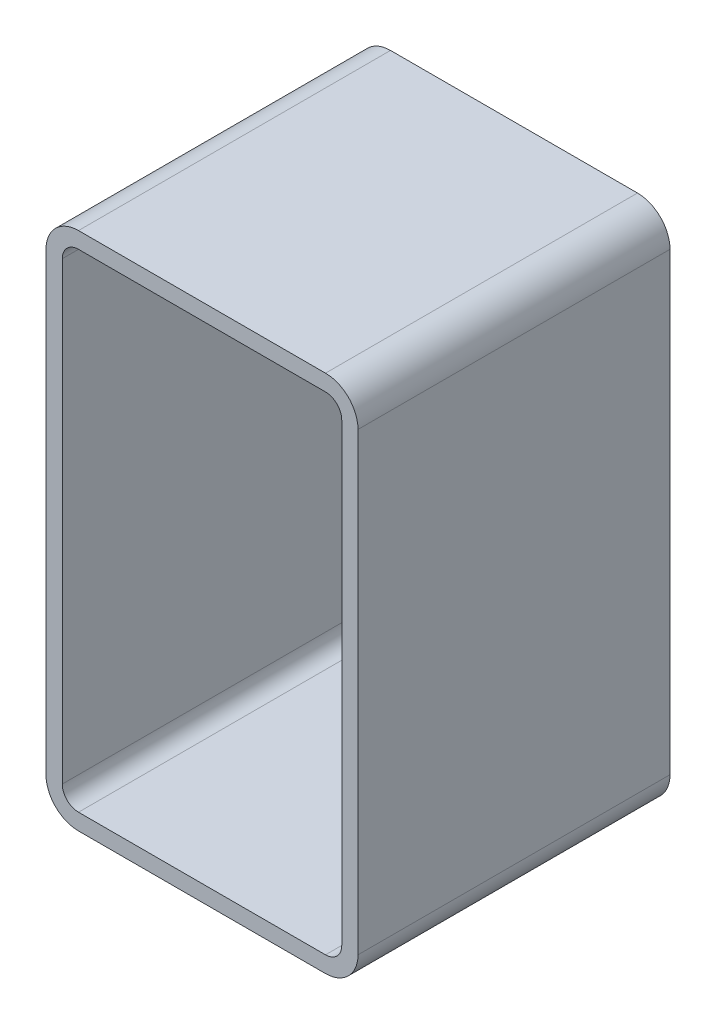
ISO-10303-21;
HEADER;
FILE_DESCRIPTION(('STEP AP214'),'2;1');
FILE_NAME('part.step','',(''),(''),'','','');
FILE_SCHEMA(('AUTOMOTIVE_DESIGN { 1 0 10303 214 1 1 1 1 }'));
ENDSEC;
DATA;
#1=APPLICATION_CONTEXT('core data for automotive mechanical design processes');
#2=APPLICATION_PROTOCOL_DEFINITION('international standard','automotive_design',2000,#1);
#3=PRODUCT_CONTEXT('',#1,'mechanical');
#4=PRODUCT('Part','Part','',(#3));
#5=PRODUCT_RELATED_PRODUCT_CATEGORY('part','',(#4));
#6=PRODUCT_DEFINITION_FORMATION('','',#4);
#7=PRODUCT_DEFINITION_CONTEXT('part definition',#1,'design');
#8=PRODUCT_DEFINITION('design','',#6,#7);
#9=PRODUCT_DEFINITION_SHAPE('','',#8);
#10=(LENGTH_UNIT() NAMED_UNIT(*) SI_UNIT(.MILLI.,.METRE.));
#11=(NAMED_UNIT(*) PLANE_ANGLE_UNIT() SI_UNIT($,.RADIAN.));
#12=(NAMED_UNIT(*) SI_UNIT($,.STERADIAN.) SOLID_ANGLE_UNIT());
#13=UNCERTAINTY_MEASURE_WITH_UNIT(LENGTH_MEASURE(1.E-05),#10,'distance_accuracy_value','');
#14=(GEOMETRIC_REPRESENTATION_CONTEXT(3) GLOBAL_UNCERTAINTY_ASSIGNED_CONTEXT((#13)) GLOBAL_UNIT_ASSIGNED_CONTEXT((#10,
#11,#12)) REPRESENTATION_CONTEXT('',''));
#15=CARTESIAN_POINT('',(0.,0.,0.));
#16=DIRECTION('',(0.,0.,1.));
#17=DIRECTION('',(1.,0.,0.));
#18=AXIS2_PLACEMENT_3D('',#15,#16,#17);
#19=CARTESIAN_POINT('',(32.8567030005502,477.941228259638,304.8));
#20=DIRECTION('',(0.,0.,1.));
#21=DIRECTION('',(1.,0.,0.));
#22=AXIS2_PLACEMENT_3D('',#19,#20,#21);
#23=PLANE('',#22);
#24=CARTESIAN_POINT('',(32.8567030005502,477.941228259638,304.8));
#25=DIRECTION('',(0.,0.,1.));
#26=DIRECTION('',(1.,0.,0.));
#27=AXIS2_PLACEMENT_3D('',#24,#25,#26);
#28=CIRCLE('',#27,31.75);
#29=CARTESIAN_POINT('',(32.8567030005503,509.691228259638,304.8));
#30=VERTEX_POINT('',#29);
#31=CARTESIAN_POINT('',(1.10670300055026,477.941228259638,304.8));
#32=VERTEX_POINT('',#31);
#33=EDGE_CURVE('E211',#30,#32,#28,.T.);
#34=ORIENTED_EDGE('',*,*,#33,.T.);
#35=DIRECTION('',(0.,-1.,0.));
#36=VECTOR('',#35,1.);
#37=CARTESIAN_POINT('',(1.10670300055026,477.941228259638,304.8));
#38=LINE('',#37,#36);
#39=CARTESIAN_POINT('',(1.10670300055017,33.4412282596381,304.8));
#40=VERTEX_POINT('',#39);
#41=EDGE_CURVE('E214',#32,#40,#38,.T.);
#42=ORIENTED_EDGE('',*,*,#41,.T.);
#43=CARTESIAN_POINT('',(32.8567030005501,33.441228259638,304.8));
#44=DIRECTION('',(0.,0.,1.));
#45=DIRECTION('',(1.,0.,0.));
#46=AXIS2_PLACEMENT_3D('',#43,#44,#45);
#47=CIRCLE('',#46,31.7499999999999);
#48=CARTESIAN_POINT('',(32.8567030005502,1.69122825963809,304.8));
#49=VERTEX_POINT('',#48);
#50=EDGE_CURVE('E217',#40,#49,#47,.T.);
#51=ORIENTED_EDGE('',*,*,#50,.T.);
#52=DIRECTION('',(1.,0.,0.));
#53=VECTOR('',#52,1.);
#54=CARTESIAN_POINT('',(32.8567030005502,1.69122825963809,304.8));
#55=LINE('',#54,#53);
#56=CARTESIAN_POINT('',(274.15670300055,1.69122825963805,304.8));
#57=VERTEX_POINT('',#56);
#58=EDGE_CURVE('E219',#49,#57,#55,.T.);
#59=ORIENTED_EDGE('',*,*,#58,.T.);
#60=CARTESIAN_POINT('',(274.15670300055,33.4412282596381,304.8));
#61=DIRECTION('',(0.,0.,1.));
#62=DIRECTION('',(1.,0.,0.));
#63=AXIS2_PLACEMENT_3D('',#60,#61,#62);
#64=CIRCLE('',#63,31.75);
#65=CARTESIAN_POINT('',(305.90670300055,33.4412282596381,304.8));
#66=VERTEX_POINT('',#65);
#67=EDGE_CURVE('E221',#57,#66,#64,.T.);
#68=ORIENTED_EDGE('',*,*,#67,.T.);
#69=DIRECTION('',(0.,1.,0.));
#70=VECTOR('',#69,1.);
#71=CARTESIAN_POINT('',(305.90670300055,33.4412282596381,304.8));
#72=LINE('',#71,#70);
#73=CARTESIAN_POINT('',(305.90670300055,477.941228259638,304.8));
#74=VERTEX_POINT('',#73);
#75=EDGE_CURVE('E223',#66,#74,#72,.T.);
#76=ORIENTED_EDGE('',*,*,#75,.T.);
#77=CARTESIAN_POINT('',(274.15670300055,477.941228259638,304.8));
#78=DIRECTION('',(0.,0.,1.));
#79=DIRECTION('',(1.,0.,0.));
#80=AXIS2_PLACEMENT_3D('',#77,#78,#79);
#81=CIRCLE('',#80,31.75);
#82=CARTESIAN_POINT('',(274.15670300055,509.691228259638,304.8));
#83=VERTEX_POINT('',#82);
#84=EDGE_CURVE('E225',#74,#83,#81,.T.);
#85=ORIENTED_EDGE('',*,*,#84,.T.);
#86=DIRECTION('',(-1.,0.,0.));
#87=VECTOR('',#86,1.);
#88=CARTESIAN_POINT('',(274.15670300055,509.691228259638,304.8));
#89=LINE('',#88,#87);
#90=EDGE_CURVE('E227',#83,#30,#89,.T.);
#91=ORIENTED_EDGE('',*,*,#90,.T.);
#92=EDGE_LOOP('',(#34,#42,#51,#59,#68,#76,#85,#91));
#93=FACE_BOUND('',#92,.T.);
#94=DIRECTION('',(0.,-1.,0.));
#95=VECTOR('',#94,1.);
#96=CARTESIAN_POINT('',(16.9817030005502,33.4412282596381,304.8));
#97=LINE('',#96,#95);
#98=CARTESIAN_POINT('',(16.9817030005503,477.941228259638,304.8));
#99=VERTEX_POINT('',#98);
#100=CARTESIAN_POINT('',(16.9817030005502,33.4412282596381,304.8));
#101=VERTEX_POINT('',#100);
#102=EDGE_CURVE('E154',#99,#101,#97,.T.);
#103=ORIENTED_EDGE('',*,*,#102,.F.);
#104=CARTESIAN_POINT('',(32.8567030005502,477.941228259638,304.8));
#105=DIRECTION('',(0.,0.,1.));
#106=DIRECTION('',(1.,0.,0.));
#107=AXIS2_PLACEMENT_3D('',#104,#105,#106);
#108=CIRCLE('',#107,15.875);
#109=CARTESIAN_POINT('',(32.8567030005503,493.816228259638,304.8));
#110=VERTEX_POINT('',#109);
#111=EDGE_CURVE('E146',#110,#99,#108,.T.);
#112=ORIENTED_EDGE('',*,*,#111,.F.);
#113=DIRECTION('',(-1.,0.,0.));
#114=VECTOR('',#113,1.);
#115=CARTESIAN_POINT('',(32.8567030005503,493.816228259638,304.8));
#116=LINE('',#115,#114);
#117=CARTESIAN_POINT('',(274.15670300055,493.816228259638,304.8));
#118=VERTEX_POINT('',#117);
#119=EDGE_CURVE('E179',#118,#110,#116,.T.);
#120=ORIENTED_EDGE('',*,*,#119,.F.);
#121=CARTESIAN_POINT('',(274.15670300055,477.941228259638,304.8));
#122=DIRECTION('',(0.,0.,1.));
#123=DIRECTION('',(1.,0.,0.));
#124=AXIS2_PLACEMENT_3D('',#121,#122,#123);
#125=CIRCLE('',#124,15.875);
#126=CARTESIAN_POINT('',(290.03170300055,477.941228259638,304.8));
#127=VERTEX_POINT('',#126);
#128=EDGE_CURVE('E177',#127,#118,#125,.T.);
#129=ORIENTED_EDGE('',*,*,#128,.F.);
#130=DIRECTION('',(0.,1.,0.));
#131=VECTOR('',#130,1.);
#132=CARTESIAN_POINT('',(290.03170300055,477.941228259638,304.8));
#133=LINE('',#132,#131);
#134=CARTESIAN_POINT('',(290.03170300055,33.4412282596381,304.8));
#135=VERTEX_POINT('',#134);
#136=EDGE_CURVE('E175',#135,#127,#133,.T.);
#137=ORIENTED_EDGE('',*,*,#136,.F.);
#138=CARTESIAN_POINT('',(274.15670300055,33.4412282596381,304.8));
#139=DIRECTION('',(0.,0.,1.));
#140=DIRECTION('',(1.,0.,0.));
#141=AXIS2_PLACEMENT_3D('',#138,#139,#140);
#142=CIRCLE('',#141,15.875);
#143=CARTESIAN_POINT('',(274.15670300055,17.5662282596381,304.8));
#144=VERTEX_POINT('',#143);
#145=EDGE_CURVE('E173',#144,#135,#142,.T.);
#146=ORIENTED_EDGE('',*,*,#145,.F.);
#147=DIRECTION('',(1.,0.,0.));
#148=VECTOR('',#147,1.);
#149=CARTESIAN_POINT('',(274.15670300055,17.566228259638,304.8));
#150=LINE('',#149,#148);
#151=CARTESIAN_POINT('',(32.8567030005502,17.5662282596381,304.8));
#152=VERTEX_POINT('',#151);
#153=EDGE_CURVE('E169',#152,#144,#150,.T.);
#154=ORIENTED_EDGE('',*,*,#153,.F.);
#155=CARTESIAN_POINT('',(32.8567030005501,33.441228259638,304.8));
#156=DIRECTION('',(0.,0.,1.));
#157=DIRECTION('',(1.,0.,0.));
#158=AXIS2_PLACEMENT_3D('',#155,#156,#157);
#159=CIRCLE('',#158,15.8749999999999);
#160=EDGE_CURVE('E167',#101,#152,#159,.T.);
#161=ORIENTED_EDGE('',*,*,#160,.F.);
#162=EDGE_LOOP('',(#103,#112,#120,#129,#137,#146,#154,#161));
#163=FACE_BOUND('',#162,.T.);
#164=ADVANCED_FACE('F33',(#93,#163),#23,.T.);
#165=CARTESIAN_POINT('',(32.8567030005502,477.941228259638,0.));
#166=DIRECTION('',(0.,0.,1.));
#167=DIRECTION('',(1.,0.,0.));
#168=AXIS2_PLACEMENT_3D('',#165,#166,#167);
#169=PLANE('',#168);
#170=CARTESIAN_POINT('',(32.8567030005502,477.941228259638,0.));
#171=DIRECTION('',(0.,0.,1.));
#172=DIRECTION('',(1.,0.,0.));
#173=AXIS2_PLACEMENT_3D('',#170,#171,#172);
#174=CIRCLE('',#173,31.75);
#175=CARTESIAN_POINT('',(32.8567030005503,509.691228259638,0.));
#176=VERTEX_POINT('',#175);
#177=CARTESIAN_POINT('',(1.10670300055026,477.941228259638,0.));
#178=VERTEX_POINT('',#177);
#179=EDGE_CURVE('E162',#176,#178,#174,.T.);
#180=ORIENTED_EDGE('',*,*,#179,.F.);
#181=DIRECTION('',(-1.,0.,0.));
#182=VECTOR('',#181,1.);
#183=CARTESIAN_POINT('',(274.15670300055,509.691228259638,0.));
#184=LINE('',#183,#182);
#185=CARTESIAN_POINT('',(274.15670300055,509.691228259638,0.));
#186=VERTEX_POINT('',#185);
#187=EDGE_CURVE('E215',#186,#176,#184,.T.);
#188=ORIENTED_EDGE('',*,*,#187,.F.);
#189=CARTESIAN_POINT('',(274.15670300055,477.941228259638,0.));
#190=DIRECTION('',(0.,0.,1.));
#191=DIRECTION('',(1.,0.,0.));
#192=AXIS2_PLACEMENT_3D('',#189,#190,#191);
#193=CIRCLE('',#192,31.75);
#194=CARTESIAN_POINT('',(305.90670300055,477.941228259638,0.));
#195=VERTEX_POINT('',#194);
#196=EDGE_CURVE('E242',#195,#186,#193,.T.);
#197=ORIENTED_EDGE('',*,*,#196,.F.);
#198=DIRECTION('',(0.,1.,0.));
#199=VECTOR('',#198,1.);
#200=CARTESIAN_POINT('',(305.90670300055,33.4412282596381,0.));
#201=LINE('',#200,#199);
#202=CARTESIAN_POINT('',(305.90670300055,33.4412282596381,0.));
#203=VERTEX_POINT('',#202);
#204=EDGE_CURVE('E240',#203,#195,#201,.T.);
#205=ORIENTED_EDGE('',*,*,#204,.F.);
#206=CARTESIAN_POINT('',(274.15670300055,33.4412282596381,0.));
#207=DIRECTION('',(0.,0.,1.));
#208=DIRECTION('',(1.,0.,0.));
#209=AXIS2_PLACEMENT_3D('',#206,#207,#208);
#210=CIRCLE('',#209,31.75);
#211=CARTESIAN_POINT('',(274.15670300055,1.69122825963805,0.));
#212=VERTEX_POINT('',#211);
#213=EDGE_CURVE('E238',#212,#203,#210,.T.);
#214=ORIENTED_EDGE('',*,*,#213,.F.);
#215=DIRECTION('',(1.,0.,0.));
#216=VECTOR('',#215,1.);
#217=CARTESIAN_POINT('',(32.8567030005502,1.69122825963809,0.));
#218=LINE('',#217,#216);
#219=CARTESIAN_POINT('',(32.8567030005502,1.69122825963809,0.));
#220=VERTEX_POINT('',#219);
#221=EDGE_CURVE('E236',#220,#212,#218,.T.);
#222=ORIENTED_EDGE('',*,*,#221,.F.);
#223=CARTESIAN_POINT('',(32.8567030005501,33.441228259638,0.));
#224=DIRECTION('',(0.,0.,1.));
#225=DIRECTION('',(1.,0.,0.));
#226=AXIS2_PLACEMENT_3D('',#223,#224,#225);
#227=CIRCLE('',#226,31.7499999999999);
#228=CARTESIAN_POINT('',(1.10670300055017,33.4412282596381,0.));
#229=VERTEX_POINT('',#228);
#230=EDGE_CURVE('E234',#229,#220,#227,.T.);
#231=ORIENTED_EDGE('',*,*,#230,.F.);
#232=DIRECTION('',(0.,-1.,0.));
#233=VECTOR('',#232,1.);
#234=CARTESIAN_POINT('',(1.10670300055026,477.941228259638,0.));
#235=LINE('',#234,#233);
#236=EDGE_CURVE('E232',#178,#229,#235,.T.);
#237=ORIENTED_EDGE('',*,*,#236,.F.);
#238=EDGE_LOOP('',(#180,#188,#197,#205,#214,#222,#231,#237));
#239=FACE_BOUND('',#238,.T.);
#240=CARTESIAN_POINT('',(32.8567030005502,477.941228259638,0.));
#241=DIRECTION('',(0.,0.,1.));
#242=DIRECTION('',(1.,0.,0.));
#243=AXIS2_PLACEMENT_3D('',#240,#241,#242);
#244=CIRCLE('',#243,15.875);
#245=CARTESIAN_POINT('',(32.8567030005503,493.816228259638,0.));
#246=VERTEX_POINT('',#245);
#247=CARTESIAN_POINT('',(16.9817030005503,477.941228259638,0.));
#248=VERTEX_POINT('',#247);
#249=EDGE_CURVE('E56',#246,#248,#244,.T.);
#250=ORIENTED_EDGE('',*,*,#249,.T.);
#251=DIRECTION('',(0.,-1.,0.));
#252=VECTOR('',#251,1.);
#253=CARTESIAN_POINT('',(16.9817030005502,33.4412282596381,0.));
#254=LINE('',#253,#252);
#255=CARTESIAN_POINT('',(16.9817030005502,33.4412282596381,0.));
#256=VERTEX_POINT('',#255);
#257=EDGE_CURVE('E161',#248,#256,#254,.T.);
#258=ORIENTED_EDGE('',*,*,#257,.T.);
#259=CARTESIAN_POINT('',(32.8567030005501,33.441228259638,0.));
#260=DIRECTION('',(0.,0.,1.));
#261=DIRECTION('',(1.,0.,0.));
#262=AXIS2_PLACEMENT_3D('',#259,#260,#261);
#263=CIRCLE('',#262,15.8749999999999);
#264=CARTESIAN_POINT('',(32.8567030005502,17.5662282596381,0.));
#265=VERTEX_POINT('',#264);
#266=EDGE_CURVE('E183',#256,#265,#263,.T.);
#267=ORIENTED_EDGE('',*,*,#266,.T.);
#268=DIRECTION('',(1.,0.,0.));
#269=VECTOR('',#268,1.);
#270=CARTESIAN_POINT('',(274.15670300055,17.566228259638,0.));
#271=LINE('',#270,#269);
#272=CARTESIAN_POINT('',(274.15670300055,17.5662282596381,0.));
#273=VERTEX_POINT('',#272);
#274=EDGE_CURVE('E186',#265,#273,#271,.T.);
#275=ORIENTED_EDGE('',*,*,#274,.T.);
#276=CARTESIAN_POINT('',(274.15670300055,33.4412282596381,0.));
#277=DIRECTION('',(0.,0.,1.));
#278=DIRECTION('',(1.,0.,0.));
#279=AXIS2_PLACEMENT_3D('',#276,#277,#278);
#280=CIRCLE('',#279,15.875);
#281=CARTESIAN_POINT('',(290.03170300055,33.4412282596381,0.));
#282=VERTEX_POINT('',#281);
#283=EDGE_CURVE('E189',#273,#282,#280,.T.);
#284=ORIENTED_EDGE('',*,*,#283,.T.);
#285=DIRECTION('',(0.,1.,0.));
#286=VECTOR('',#285,1.);
#287=CARTESIAN_POINT('',(290.03170300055,477.941228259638,0.));
#288=LINE('',#287,#286);
#289=CARTESIAN_POINT('',(290.03170300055,477.941228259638,0.));
#290=VERTEX_POINT('',#289);
#291=EDGE_CURVE('E192',#282,#290,#288,.T.);
#292=ORIENTED_EDGE('',*,*,#291,.T.);
#293=CARTESIAN_POINT('',(274.15670300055,477.941228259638,0.));
#294=DIRECTION('',(0.,0.,1.));
#295=DIRECTION('',(1.,0.,0.));
#296=AXIS2_PLACEMENT_3D('',#293,#294,#295);
#297=CIRCLE('',#296,15.875);
#298=CARTESIAN_POINT('',(274.15670300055,493.816228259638,0.));
#299=VERTEX_POINT('',#298);
#300=EDGE_CURVE('E195',#290,#299,#297,.T.);
#301=ORIENTED_EDGE('',*,*,#300,.T.);
#302=DIRECTION('',(-1.,0.,0.));
#303=VECTOR('',#302,1.);
#304=CARTESIAN_POINT('',(32.8567030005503,493.816228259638,0.));
#305=LINE('',#304,#303);
#306=EDGE_CURVE('E155',#299,#246,#305,.T.);
#307=ORIENTED_EDGE('',*,*,#306,.T.);
#308=EDGE_LOOP('',(#250,#258,#267,#275,#284,#292,#301,#307));
#309=FACE_BOUND('',#308,.T.);
#310=ADVANCED_FACE('F272',(#239,#309),#169,.F.);
#311=CARTESIAN_POINT('',(32.8567030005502,477.941228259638,304.8));
#312=DIRECTION('',(0.,0.,-1.));
#313=DIRECTION('',(-1.,0.,0.));
#314=AXIS2_PLACEMENT_3D('',#311,#312,#313);
#315=CYLINDRICAL_SURFACE('',#314,31.75);
#316=ORIENTED_EDGE('',*,*,#179,.T.);
#317=DIRECTION('',(0.,0.,-1.));
#318=VECTOR('',#317,1.);
#319=CARTESIAN_POINT('',(1.10670300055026,477.941228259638,304.8));
#320=LINE('',#319,#318);
#321=EDGE_CURVE('E11',#32,#178,#320,.T.);
#322=ORIENTED_EDGE('',*,*,#321,.F.);
#323=ORIENTED_EDGE('',*,*,#33,.F.);
#324=DIRECTION('',(0.,0.,-1.));
#325=VECTOR('',#324,1.);
#326=CARTESIAN_POINT('',(32.8567030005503,509.691228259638,304.8));
#327=LINE('',#326,#325);
#328=EDGE_CURVE('E229',#30,#176,#327,.T.);
#329=ORIENTED_EDGE('',*,*,#328,.T.);
#330=EDGE_LOOP('',(#316,#322,#323,#329));
#331=FACE_BOUND('',#330,.T.);
#332=ADVANCED_FACE('F35',(#331),#315,.T.);
#333=CARTESIAN_POINT('',(1.10670300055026,477.941228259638,304.8));
#334=DIRECTION('',(1.,0.,0.));
#335=DIRECTION('',(0.,1.,0.));
#336=AXIS2_PLACEMENT_3D('',#333,#334,#335);
#337=PLANE('',#336);
#338=ORIENTED_EDGE('',*,*,#236,.T.);
#339=DIRECTION('',(0.,0.,-1.));
#340=VECTOR('',#339,1.);
#341=CARTESIAN_POINT('',(1.10670300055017,33.4412282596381,304.8));
#342=LINE('',#341,#340);
#343=EDGE_CURVE('E41',#40,#229,#342,.T.);
#344=ORIENTED_EDGE('',*,*,#343,.F.);
#345=ORIENTED_EDGE('',*,*,#41,.F.);
#346=ORIENTED_EDGE('',*,*,#321,.T.);
#347=EDGE_LOOP('',(#338,#344,#345,#346));
#348=FACE_BOUND('',#347,.T.);
#349=ADVANCED_FACE('F289',(#348),#337,.F.);
#350=CARTESIAN_POINT('',(32.8567030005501,33.441228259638,304.8));
#351=DIRECTION('',(0.,0.,-1.));
#352=DIRECTION('',(-1.,0.,0.));
#353=AXIS2_PLACEMENT_3D('',#350,#351,#352);
#354=CYLINDRICAL_SURFACE('',#353,31.7499999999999);
#355=ORIENTED_EDGE('',*,*,#230,.T.);
#356=DIRECTION('',(0.,0.,-1.));
#357=VECTOR('',#356,1.);
#358=CARTESIAN_POINT('',(32.8567030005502,1.69122825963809,304.8));
#359=LINE('',#358,#357);
#360=EDGE_CURVE('E259',#49,#220,#359,.T.);
#361=ORIENTED_EDGE('',*,*,#360,.F.);
#362=ORIENTED_EDGE('',*,*,#50,.F.);
#363=ORIENTED_EDGE('',*,*,#343,.T.);
#364=EDGE_LOOP('',(#355,#361,#362,#363));
#365=FACE_BOUND('',#364,.T.);
#366=ADVANCED_FACE('F266',(#365),#354,.T.);
#367=CARTESIAN_POINT('',(32.8567030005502,1.69122825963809,304.8));
#368=DIRECTION('',(0.,1.,0.));
#369=DIRECTION('',(-1.,0.,0.));
#370=AXIS2_PLACEMENT_3D('',#367,#368,#369);
#371=PLANE('',#370);
#372=ORIENTED_EDGE('',*,*,#221,.T.);
#373=DIRECTION('',(0.,0.,-1.));
#374=VECTOR('',#373,1.);
#375=CARTESIAN_POINT('',(274.15670300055,1.69122825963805,304.8));
#376=LINE('',#375,#374);
#377=EDGE_CURVE('E256',#57,#212,#376,.T.);
#378=ORIENTED_EDGE('',*,*,#377,.F.);
#379=ORIENTED_EDGE('',*,*,#58,.F.);
#380=ORIENTED_EDGE('',*,*,#360,.T.);
#381=EDGE_LOOP('',(#372,#378,#379,#380));
#382=FACE_BOUND('',#381,.T.);
#383=ADVANCED_FACE('F278',(#382),#371,.F.);
#384=CARTESIAN_POINT('',(274.15670300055,33.4412282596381,304.8));
#385=DIRECTION('',(0.,0.,-1.));
#386=DIRECTION('',(-1.,0.,0.));
#387=AXIS2_PLACEMENT_3D('',#384,#385,#386);
#388=CYLINDRICAL_SURFACE('',#387,31.75);
#389=ORIENTED_EDGE('',*,*,#213,.T.);
#390=DIRECTION('',(0.,0.,-1.));
#391=VECTOR('',#390,1.);
#392=CARTESIAN_POINT('',(305.90670300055,33.4412282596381,304.8));
#393=LINE('',#392,#391);
#394=EDGE_CURVE('E253',#66,#203,#393,.T.);
#395=ORIENTED_EDGE('',*,*,#394,.F.);
#396=ORIENTED_EDGE('',*,*,#67,.F.);
#397=ORIENTED_EDGE('',*,*,#377,.T.);
#398=EDGE_LOOP('',(#389,#395,#396,#397));
#399=FACE_BOUND('',#398,.T.);
#400=ADVANCED_FACE('F282',(#399),#388,.T.);
#401=CARTESIAN_POINT('',(305.90670300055,33.4412282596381,304.8));
#402=DIRECTION('',(-1.,0.,0.));
#403=DIRECTION('',(0.,-1.,0.));
#404=AXIS2_PLACEMENT_3D('',#401,#402,#403);
#405=PLANE('',#404);
#406=ORIENTED_EDGE('',*,*,#204,.T.);
#407=DIRECTION('',(0.,0.,-1.));
#408=VECTOR('',#407,1.);
#409=CARTESIAN_POINT('',(305.90670300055,477.941228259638,304.8));
#410=LINE('',#409,#408);
#411=EDGE_CURVE('E250',#74,#195,#410,.T.);
#412=ORIENTED_EDGE('',*,*,#411,.F.);
#413=ORIENTED_EDGE('',*,*,#75,.F.);
#414=ORIENTED_EDGE('',*,*,#394,.T.);
#415=EDGE_LOOP('',(#406,#412,#413,#414));
#416=FACE_BOUND('',#415,.T.);
#417=ADVANCED_FACE('F302',(#416),#405,.F.);
#418=CARTESIAN_POINT('',(274.15670300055,477.941228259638,304.8));
#419=DIRECTION('',(0.,0.,-1.));
#420=DIRECTION('',(-1.,0.,0.));
#421=AXIS2_PLACEMENT_3D('',#418,#419,#420);
#422=CYLINDRICAL_SURFACE('',#421,31.75);
#423=ORIENTED_EDGE('',*,*,#196,.T.);
#424=DIRECTION('',(0.,0.,-1.));
#425=VECTOR('',#424,1.);
#426=CARTESIAN_POINT('',(274.15670300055,509.691228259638,304.8));
#427=LINE('',#426,#425);
#428=EDGE_CURVE('E247',#83,#186,#427,.T.);
#429=ORIENTED_EDGE('',*,*,#428,.F.);
#430=ORIENTED_EDGE('',*,*,#84,.F.);
#431=ORIENTED_EDGE('',*,*,#411,.T.);
#432=EDGE_LOOP('',(#423,#429,#430,#431));
#433=FACE_BOUND('',#432,.T.);
#434=ADVANCED_FACE('F300',(#433),#422,.T.);
#435=CARTESIAN_POINT('',(274.15670300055,509.691228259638,304.8));
#436=DIRECTION('',(0.,-1.,0.));
#437=DIRECTION('',(0.,0.,-1.));
#438=AXIS2_PLACEMENT_3D('',#435,#436,#437);
#439=PLANE('',#438);
#440=ORIENTED_EDGE('',*,*,#187,.T.);
#441=ORIENTED_EDGE('',*,*,#328,.F.);
#442=ORIENTED_EDGE('',*,*,#90,.F.);
#443=ORIENTED_EDGE('',*,*,#428,.T.);
#444=EDGE_LOOP('',(#440,#441,#442,#443));
#445=FACE_BOUND('',#444,.T.);
#446=ADVANCED_FACE('F295',(#445),#439,.F.);
#447=CARTESIAN_POINT('',(32.8567030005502,477.941228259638,304.8));
#448=DIRECTION('',(0.,0.,-1.));
#449=DIRECTION('',(-1.,0.,0.));
#450=AXIS2_PLACEMENT_3D('',#447,#448,#449);
#451=CYLINDRICAL_SURFACE('',#450,15.875);
#452=ORIENTED_EDGE('',*,*,#249,.F.);
#453=DIRECTION('',(0.,0.,-1.));
#454=VECTOR('',#453,1.);
#455=CARTESIAN_POINT('',(32.8567030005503,493.816228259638,304.8));
#456=LINE('',#455,#454);
#457=EDGE_CURVE('E150',#110,#246,#456,.T.);
#458=ORIENTED_EDGE('',*,*,#457,.F.);
#459=ORIENTED_EDGE('',*,*,#111,.T.);
#460=DIRECTION('',(0.,0.,-1.));
#461=VECTOR('',#460,1.);
#462=CARTESIAN_POINT('',(16.9817030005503,477.941228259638,304.8));
#463=LINE('',#462,#461);
#464=EDGE_CURVE('E149',#99,#248,#463,.T.);
#465=ORIENTED_EDGE('',*,*,#464,.T.);
#466=EDGE_LOOP('',(#452,#458,#459,#465));
#467=FACE_BOUND('',#466,.T.);
#468=ADVANCED_FACE('F148',(#467),#451,.F.);
#469=CARTESIAN_POINT('',(16.9817030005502,33.4412282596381,304.8));
#470=DIRECTION('',(1.,0.,0.));
#471=DIRECTION('',(0.,1.,0.));
#472=AXIS2_PLACEMENT_3D('',#469,#470,#471);
#473=PLANE('',#472);
#474=ORIENTED_EDGE('',*,*,#257,.F.);
#475=ORIENTED_EDGE('',*,*,#464,.F.);
#476=ORIENTED_EDGE('',*,*,#102,.T.);
#477=DIRECTION('',(0.,0.,-1.));
#478=VECTOR('',#477,1.);
#479=CARTESIAN_POINT('',(16.9817030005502,33.4412282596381,304.8));
#480=LINE('',#479,#478);
#481=EDGE_CURVE('E163',#101,#256,#480,.T.);
#482=ORIENTED_EDGE('',*,*,#481,.T.);
#483=EDGE_LOOP('',(#474,#475,#476,#482));
#484=FACE_BOUND('',#483,.T.);
#485=ADVANCED_FACE('F158',(#484),#473,.T.);
#486=CARTESIAN_POINT('',(32.8567030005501,33.441228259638,304.8));
#487=DIRECTION('',(0.,0.,-1.));
#488=DIRECTION('',(-1.,0.,0.));
#489=AXIS2_PLACEMENT_3D('',#486,#487,#488);
#490=CYLINDRICAL_SURFACE('',#489,15.8749999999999);
#491=ORIENTED_EDGE('',*,*,#266,.F.);
#492=ORIENTED_EDGE('',*,*,#481,.F.);
#493=ORIENTED_EDGE('',*,*,#160,.T.);
#494=DIRECTION('',(0.,0.,-1.));
#495=VECTOR('',#494,1.);
#496=CARTESIAN_POINT('',(32.8567030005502,17.5662282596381,304.8));
#497=LINE('',#496,#495);
#498=EDGE_CURVE('E208',#152,#265,#497,.T.);
#499=ORIENTED_EDGE('',*,*,#498,.T.);
#500=EDGE_LOOP('',(#491,#492,#493,#499));
#501=FACE_BOUND('',#500,.T.);
#502=ADVANCED_FACE('F327',(#501),#490,.F.);
#503=CARTESIAN_POINT('',(274.15670300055,17.566228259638,304.8));
#504=DIRECTION('',(0.,1.,0.));
#505=DIRECTION('',(-1.,0.,0.));
#506=AXIS2_PLACEMENT_3D('',#503,#504,#505);
#507=PLANE('',#506);
#508=ORIENTED_EDGE('',*,*,#274,.F.);
#509=ORIENTED_EDGE('',*,*,#498,.F.);
#510=ORIENTED_EDGE('',*,*,#153,.T.);
#511=DIRECTION('',(0.,0.,-1.));
#512=VECTOR('',#511,1.);
#513=CARTESIAN_POINT('',(274.15670300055,17.5662282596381,304.8));
#514=LINE('',#513,#512);
#515=EDGE_CURVE('E206',#144,#273,#514,.T.);
#516=ORIENTED_EDGE('',*,*,#515,.T.);
#517=EDGE_LOOP('',(#508,#509,#510,#516));
#518=FACE_BOUND('',#517,.T.);
#519=ADVANCED_FACE('F331',(#518),#507,.T.);
#520=CARTESIAN_POINT('',(274.15670300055,33.4412282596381,304.8));
#521=DIRECTION('',(0.,0.,-1.));
#522=DIRECTION('',(-1.,0.,0.));
#523=AXIS2_PLACEMENT_3D('',#520,#521,#522);
#524=CYLINDRICAL_SURFACE('',#523,15.875);
#525=ORIENTED_EDGE('',*,*,#283,.F.);
#526=ORIENTED_EDGE('',*,*,#515,.F.);
#527=ORIENTED_EDGE('',*,*,#145,.T.);
#528=DIRECTION('',(0.,0.,-1.));
#529=VECTOR('',#528,1.);
#530=CARTESIAN_POINT('',(290.03170300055,33.4412282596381,304.8));
#531=LINE('',#530,#529);
#532=EDGE_CURVE('E204',#135,#282,#531,.T.);
#533=ORIENTED_EDGE('',*,*,#532,.T.);
#534=EDGE_LOOP('',(#525,#526,#527,#533));
#535=FACE_BOUND('',#534,.T.);
#536=ADVANCED_FACE('F337',(#535),#524,.F.);
#537=CARTESIAN_POINT('',(290.03170300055,477.941228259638,304.8));
#538=DIRECTION('',(-1.,0.,0.));
#539=DIRECTION('',(0.,-1.,0.));
#540=AXIS2_PLACEMENT_3D('',#537,#538,#539);
#541=PLANE('',#540);
#542=ORIENTED_EDGE('',*,*,#291,.F.);
#543=ORIENTED_EDGE('',*,*,#532,.F.);
#544=ORIENTED_EDGE('',*,*,#136,.T.);
#545=DIRECTION('',(0.,0.,-1.));
#546=VECTOR('',#545,1.);
#547=CARTESIAN_POINT('',(290.03170300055,477.941228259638,304.8));
#548=LINE('',#547,#546);
#549=EDGE_CURVE('E202',#127,#290,#548,.T.);
#550=ORIENTED_EDGE('',*,*,#549,.T.);
#551=EDGE_LOOP('',(#542,#543,#544,#550));
#552=FACE_BOUND('',#551,.T.);
#553=ADVANCED_FACE('F341',(#552),#541,.T.);
#554=CARTESIAN_POINT('',(274.15670300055,477.941228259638,304.8));
#555=DIRECTION('',(0.,0.,-1.));
#556=DIRECTION('',(-1.,0.,0.));
#557=AXIS2_PLACEMENT_3D('',#554,#555,#556);
#558=CYLINDRICAL_SURFACE('',#557,15.875);
#559=ORIENTED_EDGE('',*,*,#300,.F.);
#560=ORIENTED_EDGE('',*,*,#549,.F.);
#561=ORIENTED_EDGE('',*,*,#128,.T.);
#562=DIRECTION('',(0.,0.,-1.));
#563=VECTOR('',#562,1.);
#564=CARTESIAN_POINT('',(274.15670300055,493.816228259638,304.8));
#565=LINE('',#564,#563);
#566=EDGE_CURVE('E48',#118,#299,#565,.T.);
#567=ORIENTED_EDGE('',*,*,#566,.T.);
#568=EDGE_LOOP('',(#559,#560,#561,#567));
#569=FACE_BOUND('',#568,.T.);
#570=ADVANCED_FACE('F345',(#569),#558,.F.);
#571=CARTESIAN_POINT('',(32.8567030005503,493.816228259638,304.8));
#572=DIRECTION('',(0.,-1.,0.));
#573=DIRECTION('',(0.,0.,-1.));
#574=AXIS2_PLACEMENT_3D('',#571,#572,#573);
#575=PLANE('',#574);
#576=ORIENTED_EDGE('',*,*,#306,.F.);
#577=ORIENTED_EDGE('',*,*,#566,.F.);
#578=ORIENTED_EDGE('',*,*,#119,.T.);
#579=ORIENTED_EDGE('',*,*,#457,.T.);
#580=EDGE_LOOP('',(#576,#577,#578,#579));
#581=FACE_BOUND('',#580,.T.);
#582=ADVANCED_FACE('F349',(#581),#575,.T.);
#583=CLOSED_SHELL('',(#164,#310,#332,#349,#366,#383,#400,#417,#434,#446,#468,#485,#502,#519,
#536,#553,#570,#582));
#584=MANIFOLD_SOLID_BREP('B2',#583);
#585=ADVANCED_BREP_SHAPE_REPRESENTATION('',(#18,#584),#14);
#586=SHAPE_DEFINITION_REPRESENTATION(#9,#585);
ENDSEC;
END-ISO-10303-21;
